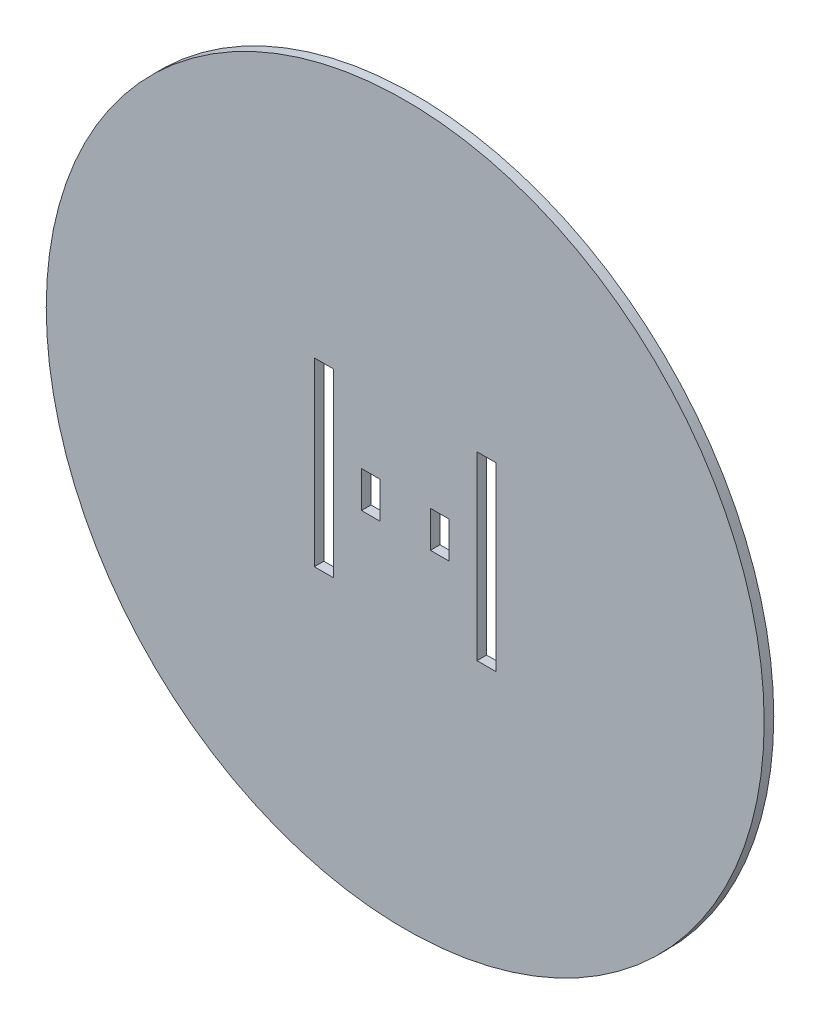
from build123d import *

# Parameters (mm, degrees)
SKETCH1_R           = 112.5
SKETCH1_W           = 5.8
SKETCH1_H           = 11.4
SKETCH1_W_2         = 5.98
SKETCH1_H_2         = 56.68
BOSS_EXTRUDE1_DEPTH = 3


with BuildPart() as part:
    # Sketch1 → Boss-Extrude1 (new body)
    with BuildSketch(Plane.XY):
        Circle(SKETCH1_R)
        with Locations((10.8, 0)):
            Rectangle(SKETCH1_W, SKETCH1_H, mode=Mode.SUBTRACT)
        with Locations((-10.8, 0)):
            Rectangle(SKETCH1_W, SKETCH1_H, mode=Mode.SUBTRACT)
        with Locations((25.49, 0)):
            Rectangle(SKETCH1_W_2, SKETCH1_H_2, mode=Mode.SUBTRACT)
        with Locations((-25.49, 0)):
            Rectangle(SKETCH1_W_2, SKETCH1_H_2, mode=Mode.SUBTRACT)
    extrude(amount=BOSS_EXTRUDE1_DEPTH)


solid = part.part
